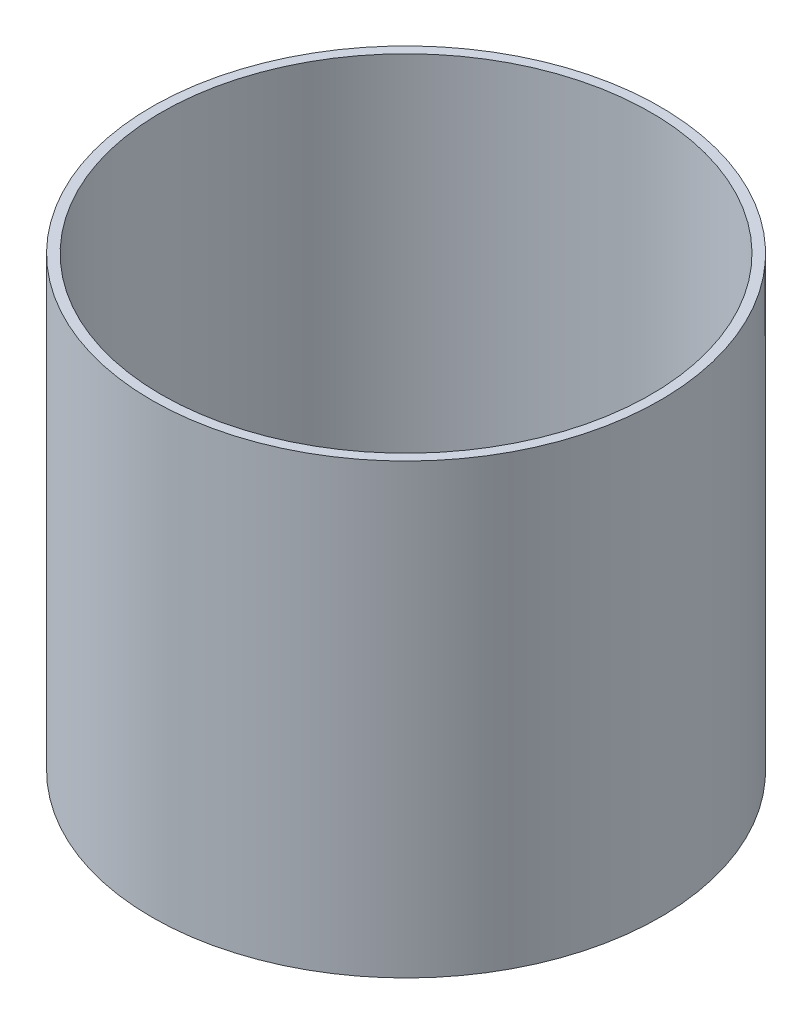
from build123d import *

# Parameters (mm, degrees)
SKETCH1_R           = 39.75
BOSS_EXTRUDE1_DEPTH = 70
SHELL1_T            = -1.5


with BuildPart() as part:
    # Sketch1 → Boss-Extrude1 (new body)
    with BuildSketch(Plane(origin=(0, 0, 0), x_dir=(1, 0, 0), z_dir=(0, 1, 0))):
        with Locations(Location((0, 0, 0), (0, 0, 270))):
            Circle(SKETCH1_R)
    extrude(amount=BOSS_EXTRUDE1_DEPTH)

    # Shell1
    shell1_openings = [part.faces().sort_by_distance(p)[0] for p in [
        (0, 70, 0),
        (0, 0, 0),
    ]]
    offset(amount=SHELL1_T, openings=shell1_openings, kind=Kind.INTERSECTION)


solid = part.part
